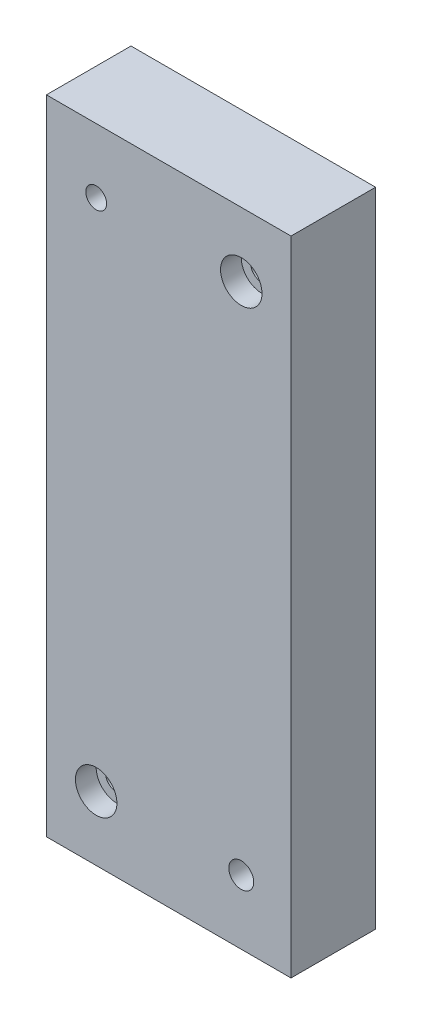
from build123d import *

# Parameters (mm, degrees)
ESQUISSE1_W                                     = 59
ESQUISSE1_H                                     = 155
ESQUISSE1_R                                     = 2.5035
ESQUISSE1_R_2                                   = 3.0035
EXTRUSION1_DEPTH                                = 20.4
CHAMBRAGE_POUR_VIS_T_TE_CYLINDRIQUE_D           = 5.5
CHAMBRAGE_POUR_VIS_T_TE_CYLINDRIQUE_CBORE_D     = 10
CHAMBRAGE_POUR_VIS_T_TE_CYLINDRIQUE_CBORE_DEPTH = 5


with BuildPart() as part:
    # Esquisse1 → Extrusion1 (new body)
    with BuildSketch(Plane.XY):
        Rectangle(ESQUISSE1_W, ESQUISSE1_H)
        with Locations((-17.5, 62)):
            Circle(ESQUISSE1_R, mode=Mode.SUBTRACT)
        with Locations((17.5, -62)):
            Circle(ESQUISSE1_R_2, mode=Mode.SUBTRACT)
    extrude(amount=EXTRUSION1_DEPTH)

    # Chambrage pour vis _ t_te cylindrique (through all)
    with Locations(Plane.XY.offset(20.4)):
        with Locations((17.5, 62), (-17.5, -62)):
            CounterBoreHole(CHAMBRAGE_POUR_VIS_T_TE_CYLINDRIQUE_D / 2, CHAMBRAGE_POUR_VIS_T_TE_CYLINDRIQUE_CBORE_D / 2, CHAMBRAGE_POUR_VIS_T_TE_CYLINDRIQUE_CBORE_DEPTH)


solid = part.part
